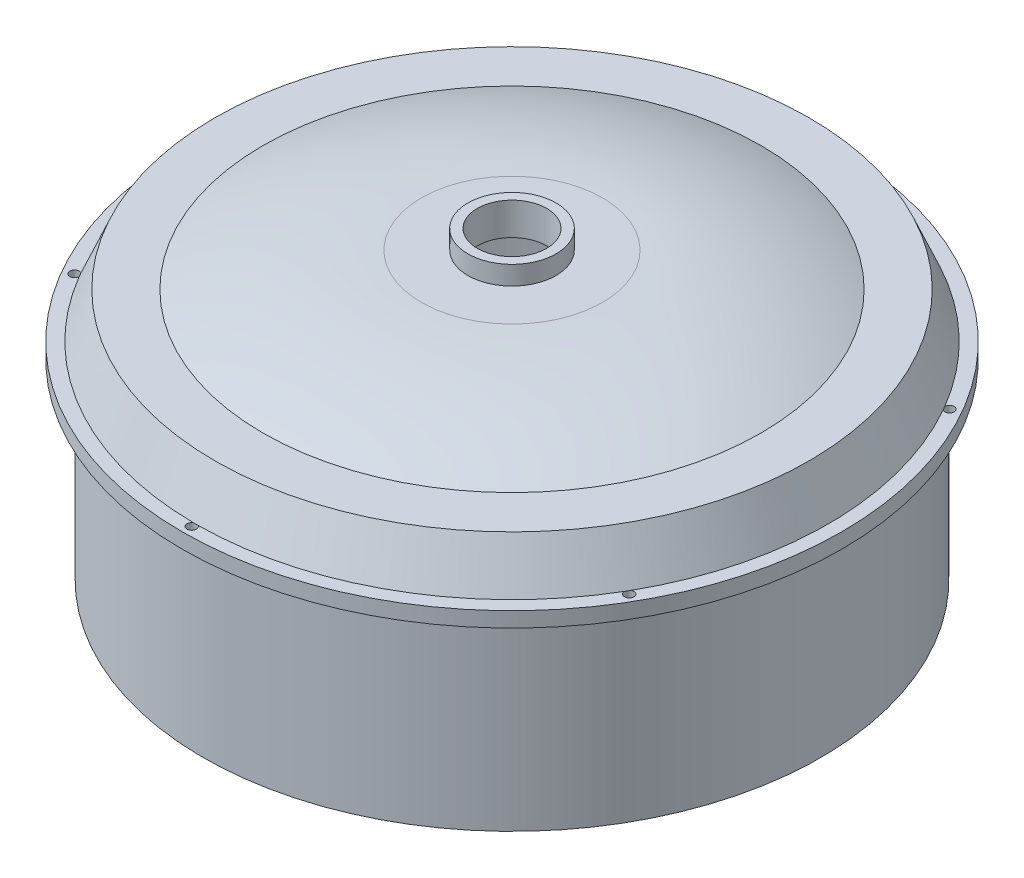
from build123d import *

# Parameters (mm, degrees)
ESQUISSE2_R                  = 1.25
ENL_V_MAT_EXTRU_1_DEPTH      = 136.258543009
R_P_TITION_CIRCULAIRE1_COUNT = 6


with BuildPart() as part:
    # Esquisse1 → Base-R_volution (revolve)
    with BuildSketch(Plane.XY, mode=Mode.PRIVATE) as base_r_volution_sk:
        with BuildLine():
            Line((78.5, 41.388888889), (78.5, -12.611111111))
            Line((78.5, -12.611111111), (82, -12.611111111))
            Line((82, -12.611111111), (82, 38))
            Line((82, 38), (87.5, 38))
            Line((87.5, 38), (87.5, 42))
            Line((87.5, 42), (83.91831641, 42))
            Line((83.91831641, 42), (78.858328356, 54))
            Line((78.858328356, 54), (66.084790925, 54))
            ThreePointArc((66.084790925, 54), (45.536731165, 60.724804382), (24.036283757, 63))
            Line((24.036283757, 63), (11.7, 63))
            Line((11.7, 63), (11.7, 68))
            Line((11.7, 68), (9.2, 68))
            Line((9.2, 68), (9.2, 59.388888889))
            Line((9.2, 59.388888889), (26.7, 59))
            ThreePointArc((26.7, 59), (45.439954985, 56.688747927), (63.397565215, 50.853335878))
            Line((63.397565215, 50.853335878), (74.509167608, 50.853335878))
            Line((74.509167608, 50.853335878), (78.5, 41.388888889))
        make_face()
    revolve(base_r_volution_sk.sketch.rotate(Axis((0, 40, 0), (0, -1, 0)), 180), axis=Axis((0, 40, 0), (0, -1, 0)))

    # Esquisse2 → Enl_v. mat.-Extru.1 (cut, through all)
    with BuildSketch(Plane(origin=(0, 42, 0), x_dir=(-1, 0, 0), z_dir=(0, 1, 0))):
        with Locations((0, 85)):
            Circle(ESQUISSE2_R)
    enl_v_mat_extru_1 = extrude(amount=-ENL_V_MAT_EXTRU_1_DEPTH, mode=Mode.SUBTRACT)

    # R_p_tition circulaire1: Enl_v. mat.-Extru.1 ×6 about axis
    r_p_tition_circulaire1_axis = Axis((0, 0, 0), (0, 1, 0))
    for i in range(1, R_P_TITION_CIRCULAIRE1_COUNT):
        add(enl_v_mat_extru_1.rotate(r_p_tition_circulaire1_axis, i * 360 / R_P_TITION_CIRCULAIRE1_COUNT), mode=Mode.SUBTRACT)


solid = part.part
